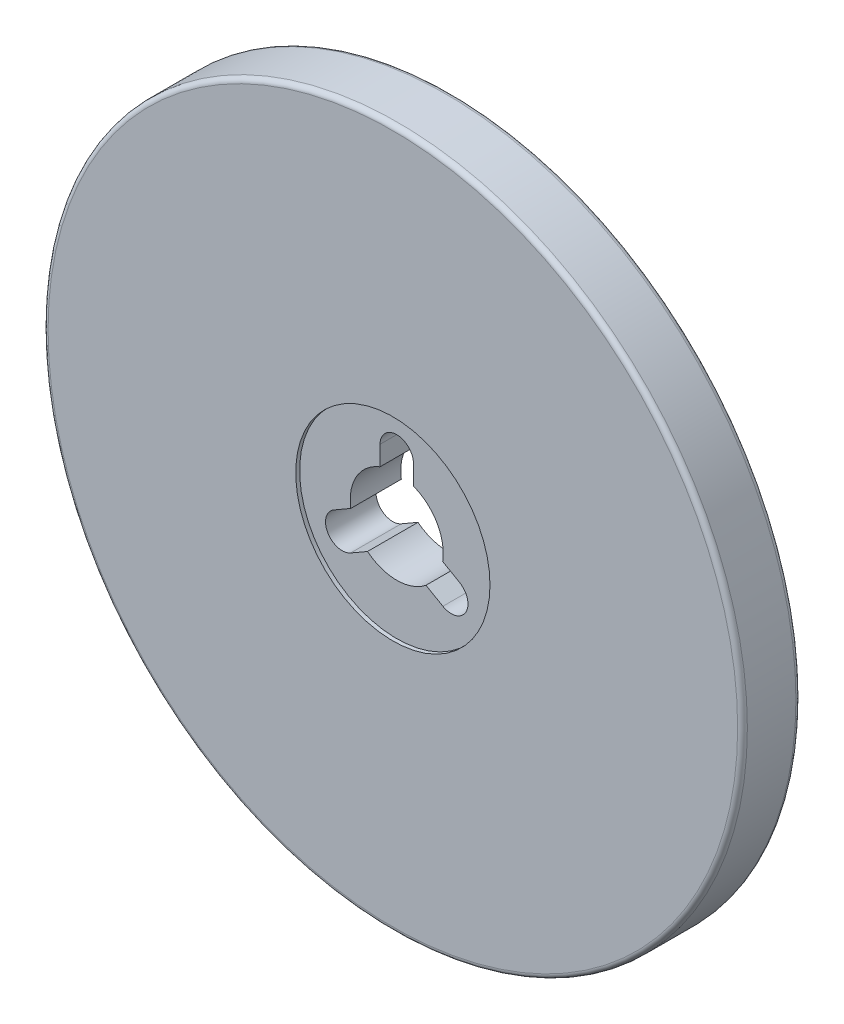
ISO-10303-21;
HEADER;
FILE_DESCRIPTION(('STEP AP214'),'2;1');
FILE_NAME('part.step','',(''),(''),'','','');
FILE_SCHEMA(('AUTOMOTIVE_DESIGN { 1 0 10303 214 1 1 1 1 }'));
ENDSEC;
DATA;
#1=APPLICATION_CONTEXT('core data for automotive mechanical design processes');
#2=APPLICATION_PROTOCOL_DEFINITION('international standard','automotive_design',2000,#1);
#3=PRODUCT_CONTEXT('',#1,'mechanical');
#4=PRODUCT('Part','Part','',(#3));
#5=PRODUCT_RELATED_PRODUCT_CATEGORY('part','',(#4));
#6=PRODUCT_DEFINITION_FORMATION('','',#4);
#7=PRODUCT_DEFINITION_CONTEXT('part definition',#1,'design');
#8=PRODUCT_DEFINITION('design','',#6,#7);
#9=PRODUCT_DEFINITION_SHAPE('','',#8);
#10=(LENGTH_UNIT() NAMED_UNIT(*) SI_UNIT(.MILLI.,.METRE.));
#11=(NAMED_UNIT(*) PLANE_ANGLE_UNIT() SI_UNIT($,.RADIAN.));
#12=(NAMED_UNIT(*) SI_UNIT($,.STERADIAN.) SOLID_ANGLE_UNIT());
#13=UNCERTAINTY_MEASURE_WITH_UNIT(LENGTH_MEASURE(1.E-05),#10,'distance_accuracy_value','');
#14=(GEOMETRIC_REPRESENTATION_CONTEXT(3) GLOBAL_UNCERTAINTY_ASSIGNED_CONTEXT((#13)) GLOBAL_UNIT_ASSIGNED_CONTEXT((#10,
#11,#12)) REPRESENTATION_CONTEXT('',''));
#15=CARTESIAN_POINT('',(0.,0.,0.));
#16=DIRECTION('',(0.,0.,1.));
#17=DIRECTION('',(1.,0.,0.));
#18=AXIS2_PLACEMENT_3D('',#15,#16,#17);
#19=CARTESIAN_POINT('',(0.,0.,-19.05));
#20=DIRECTION('',(0.,0.,1.));
#21=DIRECTION('',(1.,0.,0.));
#22=AXIS2_PLACEMENT_3D('',#19,#20,#21);
#23=CYLINDRICAL_SURFACE('',#22,30.4165);
#24=CARTESIAN_POINT('',(0.,0.,-16.51));
#25=DIRECTION('',(0.,0.,-1.));
#26=DIRECTION('',(-1.,0.,0.));
#27=AXIS2_PLACEMENT_3D('',#24,#25,#26);
#28=CIRCLE('',#27,30.4165);
#29=CARTESIAN_POINT('',(-19.1236505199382,-23.6526840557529,-16.51));
#30=VERTEX_POINT('',#29);
#31=CARTESIAN_POINT('',(19.1236505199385,-23.6526840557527,-16.51));
#32=VERTEX_POINT('',#31);
#33=EDGE_CURVE('E243',#30,#32,#28,.F.);
#34=ORIENTED_EDGE('',*,*,#33,.F.);
#35=DIRECTION('',(0.,0.,1.));
#36=VECTOR('',#35,1.);
#37=CARTESIAN_POINT('',(-19.1236505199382,-23.6526840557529,-19.05));
#38=LINE('',#37,#36);
#39=CARTESIAN_POINT('',(-19.1236505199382,-23.6526840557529,16.51));
#40=VERTEX_POINT('',#39);
#41=EDGE_CURVE('E143',#40,#30,#38,.F.);
#42=ORIENTED_EDGE('',*,*,#41,.F.);
#43=CARTESIAN_POINT('',(0.,0.,16.51));
#44=DIRECTION('',(0.,0.,1.));
#45=DIRECTION('',(1.,0.,0.));
#46=AXIS2_PLACEMENT_3D('',#43,#44,#45);
#47=CIRCLE('',#46,30.4165);
#48=CARTESIAN_POINT('',(19.1236505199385,-23.6526840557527,16.51));
#49=VERTEX_POINT('',#48);
#50=EDGE_CURVE('E242',#49,#40,#47,.F.);
#51=ORIENTED_EDGE('',*,*,#50,.F.);
#52=DIRECTION('',(0.,0.,1.));
#53=VECTOR('',#52,1.);
#54=CARTESIAN_POINT('',(19.1236505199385,-23.6526840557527,-19.05));
#55=LINE('',#54,#53);
#56=EDGE_CURVE('E138',#32,#49,#55,.T.);
#57=ORIENTED_EDGE('',*,*,#56,.F.);
#58=EDGE_LOOP('',(#34,#42,#51,#57));
#59=FACE_BOUND('',#58,.T.);
#60=ADVANCED_FACE('F34',(#59),#23,.F.);
#61=CARTESIAN_POINT('',(0.,0.,-16.51));
#62=DIRECTION('',(0.,0.,-1.));
#63=DIRECTION('',(-1.,0.,0.));
#64=AXIS2_PLACEMENT_3D('',#61,#62,#63);
#65=CIRCLE('',#64,30.4165);
#66=CARTESIAN_POINT('',(30.0456505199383,-4.73522513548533,-16.51));
#67=VERTEX_POINT('',#66);
#68=CARTESIAN_POINT('',(10.922,28.3879091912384,-16.51));
#69=VERTEX_POINT('',#68);
#70=EDGE_CURVE('E123',#67,#69,#65,.F.);
#71=ORIENTED_EDGE('',*,*,#70,.F.);
#72=DIRECTION('',(0.,0.,1.));
#73=VECTOR('',#72,1.);
#74=CARTESIAN_POINT('',(30.0456505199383,-4.73522513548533,-19.05));
#75=LINE('',#74,#73);
#76=CARTESIAN_POINT('',(30.0456505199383,-4.73522513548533,16.51));
#77=VERTEX_POINT('',#76);
#78=EDGE_CURVE('E133',#77,#67,#75,.F.);
#79=ORIENTED_EDGE('',*,*,#78,.F.);
#80=CARTESIAN_POINT('',(0.,0.,16.51));
#81=DIRECTION('',(0.,0.,1.));
#82=DIRECTION('',(1.,0.,0.));
#83=AXIS2_PLACEMENT_3D('',#80,#81,#82);
#84=CIRCLE('',#83,30.4165);
#85=CARTESIAN_POINT('',(10.922,28.3879091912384,16.51));
#86=VERTEX_POINT('',#85);
#87=EDGE_CURVE('E56',#86,#77,#84,.F.);
#88=ORIENTED_EDGE('',*,*,#87,.F.);
#89=DIRECTION('',(0.,0.,1.));
#90=VECTOR('',#89,1.);
#91=CARTESIAN_POINT('',(10.922,28.3879091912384,-19.05));
#92=LINE('',#91,#90);
#93=EDGE_CURVE('E134',#69,#86,#92,.T.);
#94=ORIENTED_EDGE('',*,*,#93,.F.);
#95=EDGE_LOOP('',(#71,#79,#88,#94));
#96=FACE_BOUND('',#95,.T.);
#97=ADVANCED_FACE('F132',(#96),#23,.F.);
#98=CARTESIAN_POINT('',(0.,0.,-16.51));
#99=DIRECTION('',(0.,0.,-1.));
#100=DIRECTION('',(-1.,0.,0.));
#101=AXIS2_PLACEMENT_3D('',#98,#99,#100);
#102=CIRCLE('',#101,30.4165);
#103=CARTESIAN_POINT('',(-10.922,28.3879091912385,-16.51));
#104=VERTEX_POINT('',#103);
#105=CARTESIAN_POINT('',(-30.0456505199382,-4.73522513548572,-16.51));
#106=VERTEX_POINT('',#105);
#107=EDGE_CURVE('E208',#104,#106,#102,.F.);
#108=ORIENTED_EDGE('',*,*,#107,.F.);
#109=DIRECTION('',(0.,0.,1.));
#110=VECTOR('',#109,1.);
#111=CARTESIAN_POINT('',(-10.922,28.3879091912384,-19.05));
#112=LINE('',#111,#110);
#113=CARTESIAN_POINT('',(-10.922,28.3879091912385,16.51));
#114=VERTEX_POINT('',#113);
#115=EDGE_CURVE('E211',#114,#104,#112,.F.);
#116=ORIENTED_EDGE('',*,*,#115,.F.);
#117=CARTESIAN_POINT('',(0.,0.,16.51));
#118=DIRECTION('',(0.,0.,1.));
#119=DIRECTION('',(1.,0.,0.));
#120=AXIS2_PLACEMENT_3D('',#117,#118,#119);
#121=CIRCLE('',#120,30.4165);
#122=CARTESIAN_POINT('',(-30.0456505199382,-4.73522513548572,16.51));
#123=VERTEX_POINT('',#122);
#124=EDGE_CURVE('E283',#123,#114,#121,.F.);
#125=ORIENTED_EDGE('',*,*,#124,.F.);
#126=DIRECTION('',(0.,0.,1.));
#127=VECTOR('',#126,1.);
#128=CARTESIAN_POINT('',(-30.0456505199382,-4.73522513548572,-19.05));
#129=LINE('',#128,#127);
#130=EDGE_CURVE('E139',#106,#123,#129,.T.);
#131=ORIENTED_EDGE('',*,*,#130,.F.);
#132=EDGE_LOOP('',(#108,#116,#125,#131));
#133=FACE_BOUND('',#132,.T.);
#134=ADVANCED_FACE('F190',(#133),#23,.F.);
#135=CARTESIAN_POINT('',(0.,41.148,828.675));
#136=DIRECTION('',(0.,0.,-1.));
#137=DIRECTION('',(-1.,0.,0.));
#138=AXIS2_PLACEMENT_3D('',#135,#136,#137);
#139=CYLINDRICAL_SURFACE('',#138,10.922);
#140=DIRECTION('',(0.,0.,-1.));
#141=VECTOR('',#140,1.);
#142=CARTESIAN_POINT('',(-10.922,41.148,828.675));
#143=LINE('',#142,#141);
#144=CARTESIAN_POINT('',(-10.922,41.148,16.51));
#145=VERTEX_POINT('',#144);
#146=CARTESIAN_POINT('',(-10.922,41.148,-16.51));
#147=VERTEX_POINT('',#146);
#148=EDGE_CURVE('E227',#145,#147,#143,.T.);
#149=ORIENTED_EDGE('',*,*,#148,.T.);
#150=CARTESIAN_POINT('',(0.,41.148,-16.51));
#151=DIRECTION('',(0.,0.,-1.));
#152=DIRECTION('',(-1.,0.,0.));
#153=AXIS2_PLACEMENT_3D('',#150,#151,#152);
#154=CIRCLE('',#153,10.922);
#155=CARTESIAN_POINT('',(10.922,41.148,-16.51));
#156=VERTEX_POINT('',#155);
#157=EDGE_CURVE('E245',#147,#156,#154,.T.);
#158=ORIENTED_EDGE('',*,*,#157,.T.);
#159=DIRECTION('',(0.,0.,-1.));
#160=VECTOR('',#159,1.);
#161=CARTESIAN_POINT('',(10.922,41.148,828.675));
#162=LINE('',#161,#160);
#163=CARTESIAN_POINT('',(10.922,41.148,16.51));
#164=VERTEX_POINT('',#163);
#165=EDGE_CURVE('E223',#164,#156,#162,.T.);
#166=ORIENTED_EDGE('',*,*,#165,.F.);
#167=CARTESIAN_POINT('',(0.,41.148,16.51));
#168=DIRECTION('',(0.,0.,1.));
#169=DIRECTION('',(1.,0.,0.));
#170=AXIS2_PLACEMENT_3D('',#167,#168,#169);
#171=CIRCLE('',#170,10.922);
#172=EDGE_CURVE('E274',#164,#145,#171,.T.);
#173=ORIENTED_EDGE('',*,*,#172,.T.);
#174=EDGE_LOOP('',(#149,#158,#166,#173));
#175=FACE_BOUND('',#174,.T.);
#176=ADVANCED_FACE('F197',(#175),#139,.F.);
#177=CARTESIAN_POINT('',(10.922,41.148,828.675));
#178=DIRECTION('',(-1.,0.,0.));
#179=DIRECTION('',(0.,0.,1.));
#180=AXIS2_PLACEMENT_3D('',#177,#178,#179);
#181=PLANE('',#180);
#182=ORIENTED_EDGE('',*,*,#165,.T.);
#183=DIRECTION('',(0.,-1.,0.));
#184=VECTOR('',#183,1.);
#185=CARTESIAN_POINT('',(10.922,41.148,-16.51));
#186=LINE('',#185,#184);
#187=EDGE_CURVE('E250',#156,#69,#186,.T.);
#188=ORIENTED_EDGE('',*,*,#187,.T.);
#189=ORIENTED_EDGE('',*,*,#93,.T.);
#190=DIRECTION('',(0.,1.,0.));
#191=VECTOR('',#190,1.);
#192=CARTESIAN_POINT('',(10.922,41.148,16.51));
#193=LINE('',#192,#191);
#194=EDGE_CURVE('E271',#86,#164,#193,.T.);
#195=ORIENTED_EDGE('',*,*,#194,.T.);
#196=EDGE_LOOP('',(#182,#188,#189,#195));
#197=FACE_BOUND('',#196,.T.);
#198=ADVANCED_FACE('F202',(#197),#181,.T.);
#199=CARTESIAN_POINT('',(-10.922,41.148,828.675));
#200=DIRECTION('',(1.,0.,0.));
#201=DIRECTION('',(0.,1.,0.));
#202=AXIS2_PLACEMENT_3D('',#199,#200,#201);
#203=PLANE('',#202);
#204=ORIENTED_EDGE('',*,*,#115,.T.);
#205=DIRECTION('',(0.,1.,0.));
#206=VECTOR('',#205,1.);
#207=CARTESIAN_POINT('',(-10.922,41.148,-16.51));
#208=LINE('',#207,#206);
#209=EDGE_CURVE('E214',#104,#147,#208,.T.);
#210=ORIENTED_EDGE('',*,*,#209,.T.);
#211=ORIENTED_EDGE('',*,*,#148,.F.);
#212=DIRECTION('',(0.,-1.,0.));
#213=VECTOR('',#212,1.);
#214=CARTESIAN_POINT('',(-10.922,41.148,16.51));
#215=LINE('',#214,#213);
#216=EDGE_CURVE('E222',#145,#114,#215,.T.);
#217=ORIENTED_EDGE('',*,*,#216,.T.);
#218=EDGE_LOOP('',(#204,#210,#211,#217));
#219=FACE_BOUND('',#218,.T.);
#220=ADVANCED_FACE('F219',(#219),#203,.T.);
#221=CARTESIAN_POINT('',(-35.635213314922,-20.5740000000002,828.675));
#222=DIRECTION('',(0.,0.,-1.));
#223=DIRECTION('',(-1.,0.,0.));
#224=AXIS2_PLACEMENT_3D('',#221,#222,#223);
#225=CYLINDRICAL_SURFACE('',#224,10.922);
#226=DIRECTION('',(0.,0.,-1.));
#227=VECTOR('',#226,1.);
#228=CARTESIAN_POINT('',(-30.174213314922,-30.0327294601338,828.675));
#229=LINE('',#228,#227);
#230=CARTESIAN_POINT('',(-30.174213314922,-30.0327294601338,16.51));
#231=VERTEX_POINT('',#230);
#232=CARTESIAN_POINT('',(-30.174213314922,-30.0327294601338,-16.51));
#233=VERTEX_POINT('',#232);
#234=EDGE_CURVE('E293',#231,#233,#229,.T.);
#235=ORIENTED_EDGE('',*,*,#234,.T.);
#236=CARTESIAN_POINT('',(-35.635213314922,-20.5740000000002,-16.51));
#237=DIRECTION('',(0.,0.,-1.));
#238=DIRECTION('',(-1.,0.,0.));
#239=AXIS2_PLACEMENT_3D('',#236,#237,#238);
#240=CIRCLE('',#239,10.922);
#241=CARTESIAN_POINT('',(-41.096213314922,-11.1152705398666,-16.51));
#242=VERTEX_POINT('',#241);
#243=EDGE_CURVE('E247',#233,#242,#240,.T.);
#244=ORIENTED_EDGE('',*,*,#243,.T.);
#245=DIRECTION('',(0.,0.,-1.));
#246=VECTOR('',#245,1.);
#247=CARTESIAN_POINT('',(-41.096213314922,-11.1152705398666,828.675));
#248=LINE('',#247,#246);
#249=CARTESIAN_POINT('',(-41.096213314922,-11.1152705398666,16.51));
#250=VERTEX_POINT('',#249);
#251=EDGE_CURVE('E295',#250,#242,#248,.T.);
#252=ORIENTED_EDGE('',*,*,#251,.F.);
#253=CARTESIAN_POINT('',(-35.635213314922,-20.5740000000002,16.51));
#254=DIRECTION('',(0.,0.,1.));
#255=DIRECTION('',(1.,0.,0.));
#256=AXIS2_PLACEMENT_3D('',#253,#254,#255);
#257=CIRCLE('',#256,10.922);
#258=EDGE_CURVE('E279',#250,#231,#257,.T.);
#259=ORIENTED_EDGE('',*,*,#258,.T.);
#260=EDGE_LOOP('',(#235,#244,#252,#259));
#261=FACE_BOUND('',#260,.T.);
#262=ADVANCED_FACE('F338',(#261),#225,.F.);
#263=CARTESIAN_POINT('',(-41.096213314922,-11.1152705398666,828.675));
#264=DIRECTION('',(0.500000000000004,-0.866025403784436,0.));
#265=DIRECTION('',(0.866025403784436,0.500000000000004,0.));
#266=AXIS2_PLACEMENT_3D('',#263,#264,#265);
#267=PLANE('',#266);
#268=ORIENTED_EDGE('',*,*,#251,.T.);
#269=DIRECTION('',(0.866025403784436,0.500000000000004,0.));
#270=VECTOR('',#269,1.);
#271=CARTESIAN_POINT('',(-41.096213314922,-11.1152705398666,-16.51));
#272=LINE('',#271,#270);
#273=EDGE_CURVE('E213',#242,#106,#272,.T.);
#274=ORIENTED_EDGE('',*,*,#273,.T.);
#275=ORIENTED_EDGE('',*,*,#130,.T.);
#276=DIRECTION('',(-0.866025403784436,-0.500000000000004,0.));
#277=VECTOR('',#276,1.);
#278=CARTESIAN_POINT('',(-41.096213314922,-11.1152705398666,16.51));
#279=LINE('',#278,#277);
#280=EDGE_CURVE('E285',#123,#250,#279,.T.);
#281=ORIENTED_EDGE('',*,*,#280,.T.);
#282=EDGE_LOOP('',(#268,#274,#275,#281));
#283=FACE_BOUND('',#282,.T.);
#284=ADVANCED_FACE('F337',(#283),#267,.T.);
#285=CARTESIAN_POINT('',(-30.174213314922,-30.0327294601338,828.675));
#286=DIRECTION('',(-0.500000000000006,0.866025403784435,0.));
#287=DIRECTION('',(-0.866025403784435,-0.500000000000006,0.));
#288=AXIS2_PLACEMENT_3D('',#285,#286,#287);
#289=PLANE('',#288);
#290=ORIENTED_EDGE('',*,*,#41,.T.);
#291=DIRECTION('',(-0.866025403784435,-0.500000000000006,0.));
#292=VECTOR('',#291,1.);
#293=CARTESIAN_POINT('',(-30.174213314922,-30.0327294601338,-16.51));
#294=LINE('',#293,#292);
#295=EDGE_CURVE('E237',#30,#233,#294,.T.);
#296=ORIENTED_EDGE('',*,*,#295,.T.);
#297=ORIENTED_EDGE('',*,*,#234,.F.);
#298=DIRECTION('',(0.866025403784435,0.500000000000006,0.));
#299=VECTOR('',#298,1.);
#300=CARTESIAN_POINT('',(-30.174213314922,-30.0327294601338,16.51));
#301=LINE('',#300,#299);
#302=EDGE_CURVE('E239',#231,#40,#301,.T.);
#303=ORIENTED_EDGE('',*,*,#302,.T.);
#304=EDGE_LOOP('',(#290,#296,#297,#303));
#305=FACE_BOUND('',#304,.T.);
#306=ADVANCED_FACE('F235',(#305),#289,.T.);
#307=CARTESIAN_POINT('',(35.6352133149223,-20.5739999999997,828.675));
#308=DIRECTION('',(0.,0.,-1.));
#309=DIRECTION('',(-1.,0.,0.));
#310=AXIS2_PLACEMENT_3D('',#307,#308,#309);
#311=CYLINDRICAL_SURFACE('',#310,10.922);
#312=DIRECTION('',(0.,0.,-1.));
#313=VECTOR('',#312,1.);
#314=CARTESIAN_POINT('',(41.0962133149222,-11.115270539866,828.675));
#315=LINE('',#314,#313);
#316=CARTESIAN_POINT('',(41.0962133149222,-11.115270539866,16.51));
#317=VERTEX_POINT('',#316);
#318=CARTESIAN_POINT('',(41.0962133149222,-11.115270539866,-16.51));
#319=VERTEX_POINT('',#318);
#320=EDGE_CURVE('E288',#317,#319,#315,.T.);
#321=ORIENTED_EDGE('',*,*,#320,.T.);
#322=CARTESIAN_POINT('',(35.6352133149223,-20.5739999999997,-16.51));
#323=DIRECTION('',(0.,0.,-1.));
#324=DIRECTION('',(-1.,0.,0.));
#325=AXIS2_PLACEMENT_3D('',#322,#323,#324);
#326=CIRCLE('',#325,10.922);
#327=CARTESIAN_POINT('',(30.1742133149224,-30.0327294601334,-16.51));
#328=VERTEX_POINT('',#327);
#329=EDGE_CURVE('E49',#319,#328,#326,.T.);
#330=ORIENTED_EDGE('',*,*,#329,.T.);
#331=DIRECTION('',(0.,0.,-1.));
#332=VECTOR('',#331,1.);
#333=CARTESIAN_POINT('',(30.1742133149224,-30.0327294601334,828.675));
#334=LINE('',#333,#332);
#335=CARTESIAN_POINT('',(30.1742133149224,-30.0327294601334,16.51));
#336=VERTEX_POINT('',#335);
#337=EDGE_CURVE('E290',#336,#328,#334,.T.);
#338=ORIENTED_EDGE('',*,*,#337,.F.);
#339=CARTESIAN_POINT('',(35.6352133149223,-20.5739999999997,16.51));
#340=DIRECTION('',(0.,0.,1.));
#341=DIRECTION('',(1.,0.,0.));
#342=AXIS2_PLACEMENT_3D('',#339,#340,#341);
#343=CIRCLE('',#342,10.922);
#344=EDGE_CURVE('E264',#336,#317,#343,.T.);
#345=ORIENTED_EDGE('',*,*,#344,.T.);
#346=EDGE_LOOP('',(#321,#330,#338,#345));
#347=FACE_BOUND('',#346,.T.);
#348=ADVANCED_FACE('F328',(#347),#311,.F.);
#349=CARTESIAN_POINT('',(30.1742133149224,-30.0327294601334,828.675));
#350=DIRECTION('',(0.499999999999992,0.866025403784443,0.));
#351=DIRECTION('',(-0.866025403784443,0.499999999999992,0.));
#352=AXIS2_PLACEMENT_3D('',#349,#350,#351);
#353=PLANE('',#352);
#354=ORIENTED_EDGE('',*,*,#337,.T.);
#355=DIRECTION('',(-0.866025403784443,0.499999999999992,0.));
#356=VECTOR('',#355,1.);
#357=CARTESIAN_POINT('',(30.1742133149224,-30.0327294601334,-16.51));
#358=LINE('',#357,#356);
#359=EDGE_CURVE('E135',#328,#32,#358,.T.);
#360=ORIENTED_EDGE('',*,*,#359,.T.);
#361=ORIENTED_EDGE('',*,*,#56,.T.);
#362=DIRECTION('',(0.866025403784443,-0.499999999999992,0.));
#363=VECTOR('',#362,1.);
#364=CARTESIAN_POINT('',(30.1742133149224,-30.0327294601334,16.51));
#365=LINE('',#364,#363);
#366=EDGE_CURVE('E268',#49,#336,#365,.T.);
#367=ORIENTED_EDGE('',*,*,#366,.T.);
#368=EDGE_LOOP('',(#354,#360,#361,#367));
#369=FACE_BOUND('',#368,.T.);
#370=ADVANCED_FACE('F327',(#369),#353,.T.);
#371=CARTESIAN_POINT('',(41.0962133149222,-11.115270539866,828.675));
#372=DIRECTION('',(-0.49999999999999,-0.866025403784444,0.));
#373=DIRECTION('',(0.866025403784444,-0.49999999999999,0.));
#374=AXIS2_PLACEMENT_3D('',#371,#372,#373);
#375=PLANE('',#374);
#376=ORIENTED_EDGE('',*,*,#78,.T.);
#377=DIRECTION('',(0.866025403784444,-0.49999999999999,0.));
#378=VECTOR('',#377,1.);
#379=CARTESIAN_POINT('',(41.0962133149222,-11.115270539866,-16.51));
#380=LINE('',#379,#378);
#381=EDGE_CURVE('E11',#67,#319,#380,.T.);
#382=ORIENTED_EDGE('',*,*,#381,.T.);
#383=ORIENTED_EDGE('',*,*,#320,.F.);
#384=DIRECTION('',(-0.866025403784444,0.49999999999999,0.));
#385=VECTOR('',#384,1.);
#386=CARTESIAN_POINT('',(41.0962133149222,-11.115270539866,16.51));
#387=LINE('',#386,#385);
#388=EDGE_CURVE('E42',#317,#77,#387,.T.);
#389=ORIENTED_EDGE('',*,*,#388,.T.);
#390=EDGE_LOOP('',(#376,#382,#383,#389));
#391=FACE_BOUND('',#390,.T.);
#392=ADVANCED_FACE('F137',(#391),#375,.T.);
#393=CARTESIAN_POINT('',(0.,0.,-19.05));
#394=DIRECTION('',(0.,0.,1.));
#395=DIRECTION('',(1.,0.,0.));
#396=AXIS2_PLACEMENT_3D('',#393,#394,#395);
#397=PLANE('',#396);
#398=CARTESIAN_POINT('',(0.,0.,-19.05));
#399=DIRECTION('',(0.,0.,1.));
#400=DIRECTION('',(1.,0.,0.));
#401=AXIS2_PLACEMENT_3D('',#398,#399,#400);
#402=CIRCLE('',#401,225.425);
#403=CARTESIAN_POINT('',(225.425,0.,-19.05));
#404=VERTEX_POINT('',#403);
#405=EDGE_CURVE('E155',#404,#404,#402,.F.);
#406=ORIENTED_EDGE('',*,*,#405,.T.);
#407=EDGE_LOOP('',(#406));
#408=FACE_BOUND('',#407,.T.);
#409=CARTESIAN_POINT('',(0.,0.,-19.05));
#410=DIRECTION('',(0.,0.,1.));
#411=DIRECTION('',(1.,0.,0.));
#412=AXIS2_PLACEMENT_3D('',#409,#410,#411);
#413=CIRCLE('',#412,63.5);
#414=CARTESIAN_POINT('',(63.5,0.,-19.05));
#415=VERTEX_POINT('',#414);
#416=EDGE_CURVE('E307',#415,#415,#413,.T.);
#417=ORIENTED_EDGE('',*,*,#416,.T.);
#418=EDGE_LOOP('',(#417));
#419=FACE_BOUND('',#418,.T.);
#420=ADVANCED_FACE('F159',(#408,#419),#397,.F.);
#421=CARTESIAN_POINT('',(0.,0.,19.05));
#422=DIRECTION('',(0.,0.,1.));
#423=DIRECTION('',(1.,0.,0.));
#424=AXIS2_PLACEMENT_3D('',#421,#422,#423);
#425=PLANE('',#424);
#426=CARTESIAN_POINT('',(0.,0.,19.05));
#427=DIRECTION('',(0.,0.,1.));
#428=DIRECTION('',(1.,0.,0.));
#429=AXIS2_PLACEMENT_3D('',#426,#427,#428);
#430=CIRCLE('',#429,63.5);
#431=CARTESIAN_POINT('',(63.5,0.,19.05));
#432=VERTEX_POINT('',#431);
#433=EDGE_CURVE('E258',#432,#432,#430,.T.);
#434=ORIENTED_EDGE('',*,*,#433,.F.);
#435=EDGE_LOOP('',(#434));
#436=FACE_BOUND('',#435,.T.);
#437=CARTESIAN_POINT('',(0.,0.,19.05));
#438=DIRECTION('',(0.,0.,1.));
#439=DIRECTION('',(1.,0.,0.));
#440=AXIS2_PLACEMENT_3D('',#437,#438,#439);
#441=CIRCLE('',#440,225.425);
#442=CARTESIAN_POINT('',(225.425,0.,19.05));
#443=VERTEX_POINT('',#442);
#444=EDGE_CURVE('E141',#443,#443,#441,.T.);
#445=ORIENTED_EDGE('',*,*,#444,.T.);
#446=EDGE_LOOP('',(#445));
#447=FACE_BOUND('',#446,.T.);
#448=ADVANCED_FACE('F172',(#436,#447),#425,.T.);
#449=CARTESIAN_POINT('',(0.,0.,19.05));
#450=DIRECTION('',(0.,0.,-1.));
#451=DIRECTION('',(-1.,0.,0.));
#452=AXIS2_PLACEMENT_3D('',#449,#450,#451);
#453=CYLINDRICAL_SURFACE('',#452,228.6);
#454=CARTESIAN_POINT('',(0.,0.,-15.875));
#455=DIRECTION('',(0.,0.,1.));
#456=DIRECTION('',(1.,0.,0.));
#457=AXIS2_PLACEMENT_3D('',#454,#455,#456);
#458=CIRCLE('',#457,228.6);
#459=CARTESIAN_POINT('',(-228.6,0.,-15.875));
#460=VERTEX_POINT('',#459);
#461=EDGE_CURVE('E152',#460,#460,#458,.T.);
#462=CARTESIAN_POINT('',(0.,0.,15.875));
#463=DIRECTION('',(0.,0.,1.));
#464=DIRECTION('',(1.,0.,0.));
#465=AXIS2_PLACEMENT_3D('',#462,#463,#464);
#466=CIRCLE('',#465,228.6);
#467=CARTESIAN_POINT('',(-228.6,0.,15.875));
#468=VERTEX_POINT('',#467);
#469=EDGE_CURVE('E149',#468,#468,#466,.F.);
#470=CARTESIAN_POINT('',(-228.6,0.,-15.875));
#471=CARTESIAN_POINT('',(-228.6,0.,-15.5442708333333));
#472=CARTESIAN_POINT('',(-228.6,0.,-15.2135416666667));
#473=CARTESIAN_POINT('',(-228.6,0.,-14.5520833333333));
#474=CARTESIAN_POINT('',(-228.6,0.,-14.2213541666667));
#475=CARTESIAN_POINT('',(-228.6,0.,-13.5598958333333));
#476=CARTESIAN_POINT('',(-228.6,0.,-13.2291666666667));
#477=CARTESIAN_POINT('',(-228.6,0.,-12.5677083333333));
#478=CARTESIAN_POINT('',(-228.6,0.,-12.2369791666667));
#479=CARTESIAN_POINT('',(-228.6,0.,-11.5755208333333));
#480=CARTESIAN_POINT('',(-228.6,0.,-11.2447916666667));
#481=CARTESIAN_POINT('',(-228.6,0.,-10.5833333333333));
#482=CARTESIAN_POINT('',(-228.6,0.,-10.2526041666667));
#483=CARTESIAN_POINT('',(-228.6,0.,-9.59114583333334));
#484=CARTESIAN_POINT('',(-228.6,0.,-9.26041666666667));
#485=CARTESIAN_POINT('',(-228.6,0.,-8.59895833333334));
#486=CARTESIAN_POINT('',(-228.6,0.,-8.26822916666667));
#487=CARTESIAN_POINT('',(-228.6,0.,-7.60677083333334));
#488=CARTESIAN_POINT('',(-228.6,0.,-7.27604166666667));
#489=CARTESIAN_POINT('',(-228.6,0.,-6.61458333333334));
#490=CARTESIAN_POINT('',(-228.6,0.,-6.28385416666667));
#491=CARTESIAN_POINT('',(-228.6,0.,-5.62239583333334));
#492=CARTESIAN_POINT('',(-228.6,0.,-5.29166666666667));
#493=CARTESIAN_POINT('',(-228.6,0.,-4.63020833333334));
#494=CARTESIAN_POINT('',(-228.6,0.,-4.29947916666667));
#495=CARTESIAN_POINT('',(-228.6,0.,-3.63802083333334));
#496=CARTESIAN_POINT('',(-228.6,0.,-3.30729166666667));
#497=CARTESIAN_POINT('',(-228.6,0.,-2.64583333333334));
#498=CARTESIAN_POINT('',(-228.6,0.,-2.31510416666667));
#499=CARTESIAN_POINT('',(-228.6,0.,-1.65364583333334));
#500=CARTESIAN_POINT('',(-228.6,0.,-1.32291666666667));
#501=CARTESIAN_POINT('',(-228.6,0.,-0.661458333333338));
#502=CARTESIAN_POINT('',(-228.6,0.,-0.330729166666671));
#503=CARTESIAN_POINT('',(-228.6,0.,0.330729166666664));
#504=CARTESIAN_POINT('',(-228.6,0.,0.661458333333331));
#505=CARTESIAN_POINT('',(-228.6,0.,1.32291666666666));
#506=CARTESIAN_POINT('',(-228.6,0.,1.65364583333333));
#507=CARTESIAN_POINT('',(-228.6,0.,2.31510416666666));
#508=CARTESIAN_POINT('',(-228.6,0.,2.64583333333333));
#509=CARTESIAN_POINT('',(-228.6,0.,3.30729166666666));
#510=CARTESIAN_POINT('',(-228.6,0.,3.63802083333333));
#511=CARTESIAN_POINT('',(-228.6,0.,4.29947916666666));
#512=CARTESIAN_POINT('',(-228.6,0.,4.63020833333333));
#513=CARTESIAN_POINT('',(-228.6,0.,5.29166666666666));
#514=CARTESIAN_POINT('',(-228.6,0.,5.62239583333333));
#515=CARTESIAN_POINT('',(-228.6,0.,6.28385416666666));
#516=CARTESIAN_POINT('',(-228.6,0.,6.61458333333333));
#517=CARTESIAN_POINT('',(-228.6,0.,7.27604166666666));
#518=CARTESIAN_POINT('',(-228.6,0.,7.60677083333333));
#519=CARTESIAN_POINT('',(-228.6,0.,8.26822916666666));
#520=CARTESIAN_POINT('',(-228.6,0.,8.59895833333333));
#521=CARTESIAN_POINT('',(-228.6,0.,9.26041666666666));
#522=CARTESIAN_POINT('',(-228.6,0.,9.59114583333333));
#523=CARTESIAN_POINT('',(-228.6,0.,10.2526041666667));
#524=CARTESIAN_POINT('',(-228.6,0.,10.5833333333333));
#525=CARTESIAN_POINT('',(-228.6,0.,11.2447916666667));
#526=CARTESIAN_POINT('',(-228.6,0.,11.5755208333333));
#527=CARTESIAN_POINT('',(-228.6,0.,12.2369791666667));
#528=CARTESIAN_POINT('',(-228.6,0.,12.5677083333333));
#529=CARTESIAN_POINT('',(-228.6,0.,13.2291666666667));
#530=CARTESIAN_POINT('',(-228.6,0.,13.5598958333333));
#531=CARTESIAN_POINT('',(-228.6,0.,14.2213541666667));
#532=CARTESIAN_POINT('',(-228.6,0.,14.5520833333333));
#533=CARTESIAN_POINT('',(-228.6,0.,15.2135416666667));
#534=CARTESIAN_POINT('',(-228.6,0.,15.5442708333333));
#535=CARTESIAN_POINT('',(-228.6,0.,15.875));
#536=B_SPLINE_CURVE_WITH_KNOTS('',3,(#470,#471,#472,#473,#474,#475,#476,#477,#478,#479,#480,
#481,#482,#483,#484,#485,#486,#487,#488,#489,#490,#491,#492,#493,#494,#495,#496,#497,#498,#499,
#500,#501,#502,#503,#504,#505,#506,#507,#508,#509,#510,#511,#512,#513,#514,#515,#516,#517,#518,
#519,#520,#521,#522,#523,#524,#525,#526,#527,#528,#529,#530,#531,#532,#533,#534,#535),
.UNSPECIFIED.,.F.,.F.,(4,2,2,2,2,2,2,2,2,2,2,2,2,2,2,2,2,2,2,2,2,2,2,2,2,2,2,2,2,2,2,2,4),(0.,
0.992187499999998,1.984375,2.9765625,3.96875,4.9609375,5.953125,6.9453125,7.9375,8.9296875,
9.921875,10.9140625,11.90625,12.8984375,13.890625,14.8828125,15.875,16.8671875,17.859375,
18.8515625,19.84375,20.8359375,21.828125,22.8203125,23.8125,24.8046875,25.796875,26.7890625,
27.78125,28.7734375,29.765625,30.7578125,31.75),.UNSPECIFIED.);
#537=EDGE_CURVE('BSEAM36',#460,#468,#536,.T.);
#538=ORIENTED_EDGE('',*,*,#461,.T.);
#539=ORIENTED_EDGE('',*,*,#469,.T.);
#540=ORIENTED_EDGE('',*,*,#537,.T.);
#541=ORIENTED_EDGE('',*,*,#537,.F.);
#542=EDGE_LOOP('',(#538,#540,#539,#541));
#543=FACE_BOUND('',#542,.T.);
#544=ADVANCED_FACE('F36',(#543),#453,.T.);
#545=CARTESIAN_POINT('',(0.,0.,15.875));
#546=DIRECTION('',(0.,0.,1.));
#547=DIRECTION('',(1.,0.,0.));
#548=AXIS2_PLACEMENT_3D('',#545,#546,#547);
#549=TOROIDAL_SURFACE('',#548,225.425,3.175);
#550=ORIENTED_EDGE('',*,*,#469,.F.);
#551=EDGE_LOOP('',(#550));
#552=FACE_BOUND('',#551,.T.);
#553=ORIENTED_EDGE('',*,*,#444,.F.);
#554=EDGE_LOOP('',(#553));
#555=FACE_BOUND('',#554,.T.);
#556=ADVANCED_FACE('F166',(#552,#555),#549,.T.);
#557=CARTESIAN_POINT('',(0.,0.,-15.875));
#558=DIRECTION('',(0.,0.,1.));
#559=DIRECTION('',(1.,0.,0.));
#560=AXIS2_PLACEMENT_3D('',#557,#558,#559);
#561=TOROIDAL_SURFACE('',#560,225.425,3.175);
#562=ORIENTED_EDGE('',*,*,#405,.F.);
#563=EDGE_LOOP('',(#562));
#564=FACE_BOUND('',#563,.T.);
#565=ORIENTED_EDGE('',*,*,#461,.F.);
#566=EDGE_LOOP('',(#565));
#567=FACE_BOUND('',#566,.T.);
#568=ADVANCED_FACE('F162',(#564,#567),#561,.T.);
#569=CARTESIAN_POINT('',(0.,0.,16.51));
#570=DIRECTION('',(0.,0.,1.));
#571=DIRECTION('',(1.,0.,0.));
#572=AXIS2_PLACEMENT_3D('',#569,#570,#571);
#573=CYLINDRICAL_SURFACE('',#572,63.5);
#574=CARTESIAN_POINT('',(0.,0.,16.51));
#575=DIRECTION('',(0.,0.,1.));
#576=DIRECTION('',(1.,0.,0.));
#577=AXIS2_PLACEMENT_3D('',#574,#575,#576);
#578=CIRCLE('',#577,63.5);
#579=CARTESIAN_POINT('',(63.5,0.,16.51));
#580=VERTEX_POINT('',#579);
#581=EDGE_CURVE('E261',#580,#580,#578,.T.);
#582=ORIENTED_EDGE('',*,*,#581,.F.);
#583=EDGE_LOOP('',(#582));
#584=FACE_BOUND('',#583,.T.);
#585=ORIENTED_EDGE('',*,*,#433,.T.);
#586=EDGE_LOOP('',(#585));
#587=FACE_BOUND('',#586,.T.);
#588=ADVANCED_FACE('F165',(#584,#587),#573,.F.);
#589=CARTESIAN_POINT('',(0.,0.,16.51));
#590=DIRECTION('',(0.,0.,1.));
#591=DIRECTION('',(1.,0.,0.));
#592=AXIS2_PLACEMENT_3D('',#589,#590,#591);
#593=PLANE('',#592);
#594=ORIENTED_EDGE('',*,*,#124,.T.);
#595=ORIENTED_EDGE('',*,*,#216,.F.);
#596=ORIENTED_EDGE('',*,*,#172,.F.);
#597=ORIENTED_EDGE('',*,*,#194,.F.);
#598=ORIENTED_EDGE('',*,*,#87,.T.);
#599=ORIENTED_EDGE('',*,*,#388,.F.);
#600=ORIENTED_EDGE('',*,*,#344,.F.);
#601=ORIENTED_EDGE('',*,*,#366,.F.);
#602=ORIENTED_EDGE('',*,*,#50,.T.);
#603=ORIENTED_EDGE('',*,*,#302,.F.);
#604=ORIENTED_EDGE('',*,*,#258,.F.);
#605=ORIENTED_EDGE('',*,*,#280,.F.);
#606=EDGE_LOOP('',(#594,#595,#596,#597,#598,#599,#600,#601,#602,#603,#604,#605));
#607=FACE_BOUND('',#606,.T.);
#608=ORIENTED_EDGE('',*,*,#581,.T.);
#609=EDGE_LOOP('',(#608));
#610=FACE_BOUND('',#609,.T.);
#611=ADVANCED_FACE('F298',(#607,#610),#593,.T.);
#612=CARTESIAN_POINT('',(0.,0.,-16.51));
#613=DIRECTION('',(0.,0.,-1.));
#614=DIRECTION('',(-1.,0.,0.));
#615=AXIS2_PLACEMENT_3D('',#612,#613,#614);
#616=CYLINDRICAL_SURFACE('',#615,63.5);
#617=CARTESIAN_POINT('',(0.,0.,-16.51));
#618=DIRECTION('',(0.,0.,1.));
#619=DIRECTION('',(1.,0.,0.));
#620=AXIS2_PLACEMENT_3D('',#617,#618,#619);
#621=CIRCLE('',#620,63.5);
#622=CARTESIAN_POINT('',(63.5,0.,-16.51));
#623=VERTEX_POINT('',#622);
#624=EDGE_CURVE('E304',#623,#623,#621,.T.);
#625=ORIENTED_EDGE('',*,*,#624,.T.);
#626=EDGE_LOOP('',(#625));
#627=FACE_BOUND('',#626,.T.);
#628=ORIENTED_EDGE('',*,*,#416,.F.);
#629=EDGE_LOOP('',(#628));
#630=FACE_BOUND('',#629,.T.);
#631=ADVANCED_FACE('F311',(#627,#630),#616,.F.);
#632=CARTESIAN_POINT('',(0.,0.,-16.51));
#633=DIRECTION('',(0.,0.,-1.));
#634=DIRECTION('',(1.,0.,0.));
#635=AXIS2_PLACEMENT_3D('',#632,#633,#634);
#636=PLANE('',#635);
#637=ORIENTED_EDGE('',*,*,#243,.F.);
#638=ORIENTED_EDGE('',*,*,#295,.F.);
#639=ORIENTED_EDGE('',*,*,#33,.T.);
#640=ORIENTED_EDGE('',*,*,#359,.F.);
#641=ORIENTED_EDGE('',*,*,#329,.F.);
#642=ORIENTED_EDGE('',*,*,#381,.F.);
#643=ORIENTED_EDGE('',*,*,#70,.T.);
#644=ORIENTED_EDGE('',*,*,#187,.F.);
#645=ORIENTED_EDGE('',*,*,#157,.F.);
#646=ORIENTED_EDGE('',*,*,#209,.F.);
#647=ORIENTED_EDGE('',*,*,#107,.T.);
#648=ORIENTED_EDGE('',*,*,#273,.F.);
#649=EDGE_LOOP('',(#637,#638,#639,#640,#641,#642,#643,#644,#645,#646,#647,#648));
#650=FACE_BOUND('',#649,.T.);
#651=ORIENTED_EDGE('',*,*,#624,.F.);
#652=EDGE_LOOP('',(#651));
#653=FACE_BOUND('',#652,.T.);
#654=ADVANCED_FACE('F121',(#650,#653),#636,.T.);
#655=CLOSED_SHELL('',(#60,#97,#134,#176,#198,#220,#262,#284,#306,#348,#370,#392,#420,#448,#544,
#556,#568,#588,#611,#631,#654));
#656=MANIFOLD_SOLID_BREP('B2',#655);
#657=ADVANCED_BREP_SHAPE_REPRESENTATION('',(#18,#656),#14);
#658=SHAPE_DEFINITION_REPRESENTATION(#9,#657);
ENDSEC;
END-ISO-10303-21;
